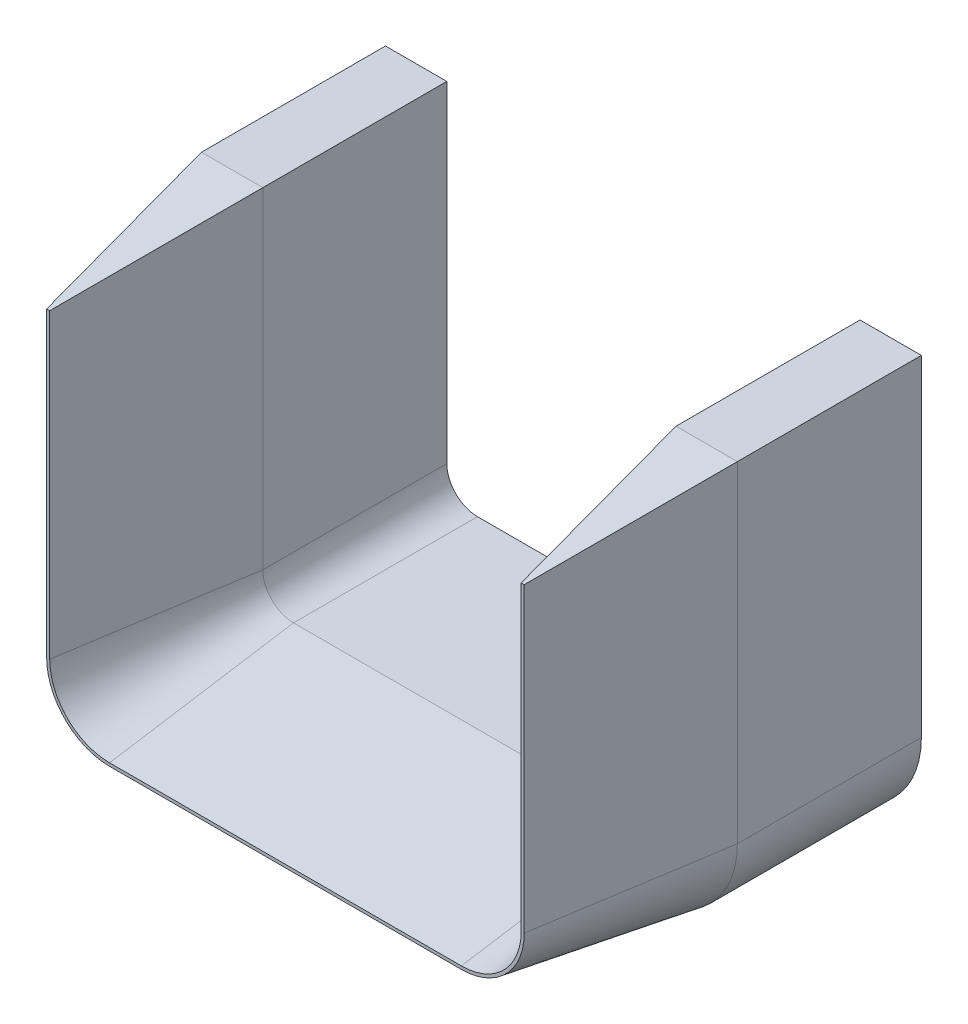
from build123d import *

# Parameters (mm, degrees)
EXTRUDE_THIN1_DEPTH           = 30
EXTRUDE_THIN1_TAPER           = 9.000000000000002
EXTRUDE_THIN1_OTHER_WAY_DEPTH = 30


with BuildPart() as part:
    # Sketch1 → Extrude-Thin1 (new body)
    with BuildSketch(Plane.XY):
        with BuildLine():
            Line((-38.26989966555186, 24.911538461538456), (-38.26989966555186, -29.0464882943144))
            ThreePointArc((-38.26989966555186, -29.0464882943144), (-33.876501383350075, -39.653090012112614), (-23.26989966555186, -44.0464882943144))
            Line((-23.26989966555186, -44.0464882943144), (34.10100334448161, -44.0464882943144))
            ThreePointArc((34.10100334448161, -44.0464882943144), (44.707605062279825, -39.653090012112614), (49.10100334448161, -29.0464882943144))
            Line((49.10100334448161, -29.0464882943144), (49.10100334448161, 24.911538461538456))
            Line((49.10100334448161, 24.911538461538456), (39.10100334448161, 24.911538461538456))
            Line((39.10100334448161, 24.911538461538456), (39.10100334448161, -29.0464882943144))
            ThreePointArc((39.10100334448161, -29.0464882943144), (37.63653725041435, -32.58202220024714), (34.10100334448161, -34.0464882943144))
            Line((34.10100334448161, -34.0464882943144), (-23.26989966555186, -34.0464882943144))
            ThreePointArc((-23.26989966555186, -34.0464882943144), (-26.8054335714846, -32.58202220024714), (-28.26989966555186, -29.0464882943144))
            Line((-28.26989966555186, -29.0464882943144), (-28.26989966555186, 24.911538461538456))
            Line((-28.26989966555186, 24.911538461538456), (-38.26989966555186, 24.911538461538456))
        make_face()
    extrude(amount=EXTRUDE_THIN1_DEPTH, taper=EXTRUDE_THIN1_TAPER)

    # Sketch1 → Extrude-Thin1 other way (add)
    with BuildSketch(Plane.XY):
        with BuildLine():
            Line((-38.26989966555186, 24.911538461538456), (-38.26989966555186, -29.0464882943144))
            ThreePointArc((-38.26989966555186, -29.0464882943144), (-33.876501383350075, -39.653090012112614), (-23.26989966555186, -44.0464882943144))
            Line((-23.26989966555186, -44.0464882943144), (34.10100334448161, -44.0464882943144))
            ThreePointArc((34.10100334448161, -44.0464882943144), (44.707605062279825, -39.653090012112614), (49.10100334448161, -29.0464882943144))
            Line((49.10100334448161, -29.0464882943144), (49.10100334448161, 24.911538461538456))
            Line((49.10100334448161, 24.911538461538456), (39.10100334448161, 24.911538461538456))
            Line((39.10100334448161, 24.911538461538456), (39.10100334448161, -29.0464882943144))
            ThreePointArc((39.10100334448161, -29.0464882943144), (37.63653725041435, -32.58202220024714), (34.10100334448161, -34.0464882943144))
            Line((34.10100334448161, -34.0464882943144), (-23.26989966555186, -34.0464882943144))
            ThreePointArc((-23.26989966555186, -34.0464882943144), (-26.8054335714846, -32.58202220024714), (-28.26989966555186, -29.0464882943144))
            Line((-28.26989966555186, -29.0464882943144), (-28.26989966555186, 24.911538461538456))
            Line((-28.26989966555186, 24.911538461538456), (-38.26989966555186, 24.911538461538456))
        make_face()
    extrude(amount=-EXTRUDE_THIN1_OTHER_WAY_DEPTH)


solid = part.part
